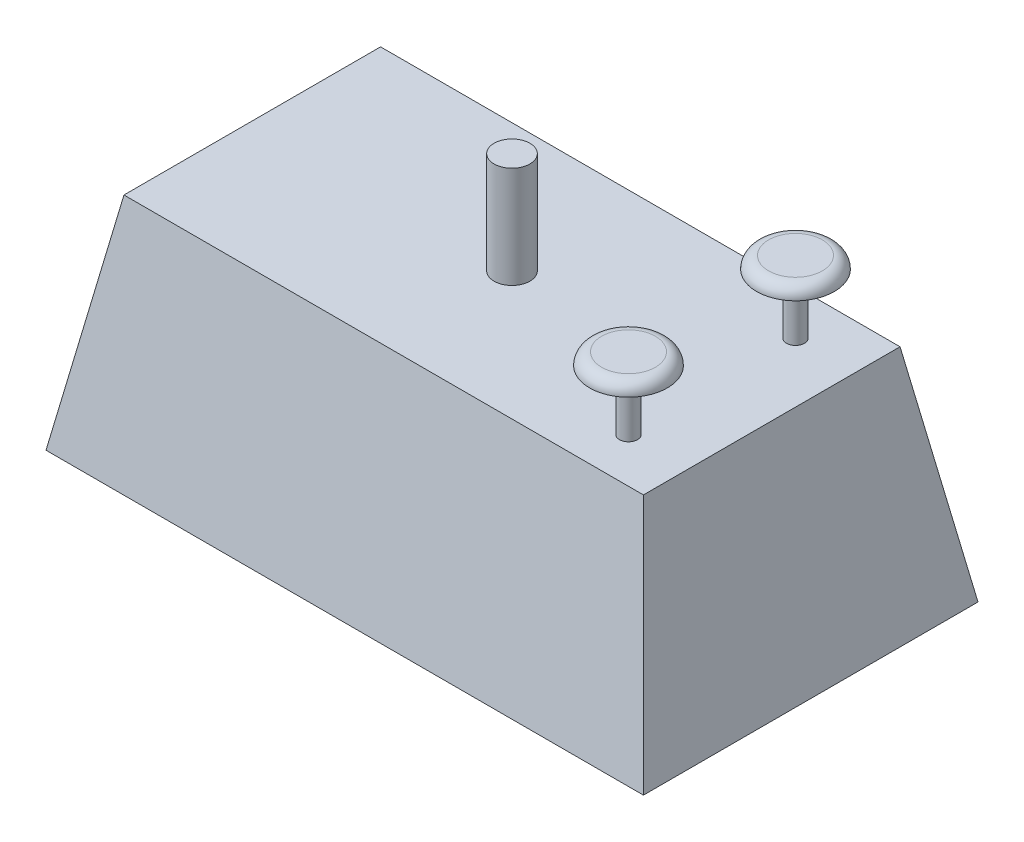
ISO-10303-21;
HEADER;
FILE_DESCRIPTION(('STEP AP214'),'2;1');
FILE_NAME('part.step','',(''),(''),'','','');
FILE_SCHEMA(('AUTOMOTIVE_DESIGN { 1 0 10303 214 1 1 1 1 }'));
ENDSEC;
DATA;
#1=APPLICATION_CONTEXT('core data for automotive mechanical design processes');
#2=APPLICATION_PROTOCOL_DEFINITION('international standard','automotive_design',2000,#1);
#3=PRODUCT_CONTEXT('',#1,'mechanical');
#4=PRODUCT('Part','Part','',(#3));
#5=PRODUCT_RELATED_PRODUCT_CATEGORY('part','',(#4));
#6=PRODUCT_DEFINITION_FORMATION('','',#4);
#7=PRODUCT_DEFINITION_CONTEXT('part definition',#1,'design');
#8=PRODUCT_DEFINITION('design','',#6,#7);
#9=PRODUCT_DEFINITION_SHAPE('','',#8);
#10=(LENGTH_UNIT() NAMED_UNIT(*) SI_UNIT(.MILLI.,.METRE.));
#11=(NAMED_UNIT(*) PLANE_ANGLE_UNIT() SI_UNIT($,.RADIAN.));
#12=(NAMED_UNIT(*) SI_UNIT($,.STERADIAN.) SOLID_ANGLE_UNIT());
#13=UNCERTAINTY_MEASURE_WITH_UNIT(LENGTH_MEASURE(1.E-05),#10,'distance_accuracy_value','');
#14=(GEOMETRIC_REPRESENTATION_CONTEXT(3) GLOBAL_UNCERTAINTY_ASSIGNED_CONTEXT((#13)) GLOBAL_UNIT_ASSIGNED_CONTEXT((#10,
#11,#12)) REPRESENTATION_CONTEXT('',''));
#15=CARTESIAN_POINT('',(0.,0.,0.));
#16=DIRECTION('',(0.,0.,1.));
#17=DIRECTION('',(1.,0.,0.));
#18=AXIS2_PLACEMENT_3D('',#15,#16,#17);
#19=CARTESIAN_POINT('',(-500.,0.,-280.));
#20=DIRECTION('',(-0.984807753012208,0.173648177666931,0.));
#21=DIRECTION('',(-0.173648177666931,-0.984807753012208,0.));
#22=AXIS2_PLACEMENT_3D('',#19,#20,#21);
#23=PLANE('',#22);
#24=DIRECTION('',(0.,0.,1.));
#25=VECTOR('',#24,1.);
#26=CARTESIAN_POINT('',(-500.,0.,-280.));
#27=LINE('',#26,#25);
#28=CARTESIAN_POINT('',(-500.,0.,-280.));
#29=VERTEX_POINT('',#28);
#30=CARTESIAN_POINT('',(-500.,0.,280.));
#31=VERTEX_POINT('',#30);
#32=EDGE_CURVE('E92',#29,#31,#27,.T.);
#33=ORIENTED_EDGE('',*,*,#32,.T.);
#34=DIRECTION('',(-0.171087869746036,-0.970287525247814,0.171087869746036));
#35=VECTOR('',#34,1.);
#36=CARTESIAN_POINT('',(-500.,0.,280.));
#37=LINE('',#36,#35);
#38=CARTESIAN_POINT('',(-434.759017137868,370.,214.759017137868));
#39=VERTEX_POINT('',#38);
#40=EDGE_CURVE('E100',#39,#31,#37,.T.);
#41=ORIENTED_EDGE('',*,*,#40,.F.);
#42=DIRECTION('',(0.,0.,-1.));
#43=VECTOR('',#42,1.);
#44=CARTESIAN_POINT('',(-434.759017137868,370.,-280.));
#45=LINE('',#44,#43);
#46=CARTESIAN_POINT('',(-434.759017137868,370.,-214.759017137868));
#47=VERTEX_POINT('',#46);
#48=EDGE_CURVE('E124',#47,#39,#45,.F.);
#49=ORIENTED_EDGE('',*,*,#48,.F.);
#50=DIRECTION('',(-0.171087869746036,-0.970287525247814,-0.171087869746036));
#51=VECTOR('',#50,1.);
#52=CARTESIAN_POINT('',(-500.,0.,-280.));
#53=LINE('',#52,#51);
#54=EDGE_CURVE('E110',#47,#29,#53,.T.);
#55=ORIENTED_EDGE('',*,*,#54,.T.);
#56=EDGE_LOOP('',(#33,#41,#49,#55));
#57=FACE_BOUND('',#56,.T.);
#58=ADVANCED_FACE('F45',(#57),#23,.T.);
#59=CARTESIAN_POINT('',(-500.,0.,280.));
#60=DIRECTION('',(0.,0.173648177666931,0.984807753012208));
#61=DIRECTION('',(0.,-0.984807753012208,0.173648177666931));
#62=AXIS2_PLACEMENT_3D('',#59,#60,#61);
#63=PLANE('',#62);
#64=DIRECTION('',(1.,0.,0.));
#65=VECTOR('',#64,1.);
#66=CARTESIAN_POINT('',(-500.,0.,280.));
#67=LINE('',#66,#65);
#68=CARTESIAN_POINT('',(500.,0.,280.));
#69=VERTEX_POINT('',#68);
#70=EDGE_CURVE('E87',#31,#69,#67,.T.);
#71=ORIENTED_EDGE('',*,*,#70,.T.);
#72=DIRECTION('',(0.171087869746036,-0.970287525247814,0.171087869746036));
#73=VECTOR('',#72,1.);
#74=CARTESIAN_POINT('',(483.608206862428,92.9624784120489,263.608206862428));
#75=LINE('',#74,#73);
#76=CARTESIAN_POINT('',(434.759017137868,370.,214.759017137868));
#77=VERTEX_POINT('',#76);
#78=EDGE_CURVE('E107',#77,#69,#75,.T.);
#79=ORIENTED_EDGE('',*,*,#78,.F.);
#80=DIRECTION('',(-1.,0.,0.));
#81=VECTOR('',#80,1.);
#82=CARTESIAN_POINT('',(-500.,370.,214.759017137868));
#83=LINE('',#82,#81);
#84=EDGE_CURVE('E102',#39,#77,#83,.F.);
#85=ORIENTED_EDGE('',*,*,#84,.F.);
#86=ORIENTED_EDGE('',*,*,#40,.T.);
#87=EDGE_LOOP('',(#71,#79,#85,#86));
#88=FACE_BOUND('',#87,.T.);
#89=ADVANCED_FACE('F101',(#88),#63,.T.);
#90=CARTESIAN_POINT('',(500.,0.,-280.));
#91=DIRECTION('',(0.984807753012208,0.173648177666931,0.));
#92=DIRECTION('',(-0.173648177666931,0.984807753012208,0.));
#93=AXIS2_PLACEMENT_3D('',#90,#91,#92);
#94=PLANE('',#93);
#95=DIRECTION('',(0.,0.,-1.));
#96=VECTOR('',#95,1.);
#97=CARTESIAN_POINT('',(500.,0.,-280.));
#98=LINE('',#97,#96);
#99=CARTESIAN_POINT('',(500.,0.,-280.));
#100=VERTEX_POINT('',#99);
#101=EDGE_CURVE('E93',#69,#100,#98,.T.);
#102=ORIENTED_EDGE('',*,*,#101,.T.);
#103=DIRECTION('',(0.171087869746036,-0.970287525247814,-0.171087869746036));
#104=VECTOR('',#103,1.);
#105=CARTESIAN_POINT('',(470.728940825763,166.004425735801,-250.728940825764));
#106=LINE('',#105,#104);
#107=CARTESIAN_POINT('',(434.759017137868,370.,-214.759017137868));
#108=VERTEX_POINT('',#107);
#109=EDGE_CURVE('E128',#108,#100,#106,.T.);
#110=ORIENTED_EDGE('',*,*,#109,.F.);
#111=DIRECTION('',(0.,0.,1.));
#112=VECTOR('',#111,1.);
#113=CARTESIAN_POINT('',(434.759017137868,370.,-280.));
#114=LINE('',#113,#112);
#115=EDGE_CURVE('E66',#77,#108,#114,.F.);
#116=ORIENTED_EDGE('',*,*,#115,.F.);
#117=ORIENTED_EDGE('',*,*,#78,.T.);
#118=EDGE_LOOP('',(#102,#110,#116,#117));
#119=FACE_BOUND('',#118,.T.);
#120=ADVANCED_FACE('F182',(#119),#94,.T.);
#121=CARTESIAN_POINT('',(-500.,0.,-280.));
#122=DIRECTION('',(0.,0.173648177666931,-0.984807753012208));
#123=DIRECTION('',(0.,0.984807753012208,0.173648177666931));
#124=AXIS2_PLACEMENT_3D('',#121,#122,#123);
#125=PLANE('',#124);
#126=DIRECTION('',(-1.,0.,0.));
#127=VECTOR('',#126,1.);
#128=CARTESIAN_POINT('',(-500.,0.,-280.));
#129=LINE('',#128,#127);
#130=EDGE_CURVE('E122',#100,#29,#129,.T.);
#131=ORIENTED_EDGE('',*,*,#130,.T.);
#132=ORIENTED_EDGE('',*,*,#54,.F.);
#133=DIRECTION('',(1.,0.,0.));
#134=VECTOR('',#133,1.);
#135=CARTESIAN_POINT('',(-500.,370.,-214.759017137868));
#136=LINE('',#135,#134);
#137=EDGE_CURVE('E61',#108,#47,#136,.F.);
#138=ORIENTED_EDGE('',*,*,#137,.F.);
#139=ORIENTED_EDGE('',*,*,#109,.T.);
#140=EDGE_LOOP('',(#131,#132,#138,#139));
#141=FACE_BOUND('',#140,.T.);
#142=ADVANCED_FACE('F186',(#141),#125,.T.);
#143=CARTESIAN_POINT('',(0.,370.,0.));
#144=DIRECTION('',(0.,1.,0.));
#145=DIRECTION('',(0.,0.,1.));
#146=AXIS2_PLACEMENT_3D('',#143,#144,#145);
#147=PLANE('',#146);
#148=CARTESIAN_POINT('',(0.,370.,0.));
#149=DIRECTION('',(0.,1.,0.));
#150=DIRECTION('',(0.,0.,1.));
#151=AXIS2_PLACEMENT_3D('',#148,#149,#150);
#152=CIRCLE('',#151,30.);
#153=CARTESIAN_POINT('',(0.,370.,30.));
#154=VERTEX_POINT('',#153);
#155=EDGE_CURVE('E266',#154,#154,#152,.T.);
#156=ORIENTED_EDGE('',*,*,#155,.F.);
#157=EDGE_LOOP('',(#156));
#158=FACE_BOUND('',#157,.T.);
#159=CARTESIAN_POINT('',(334.759017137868,370.,139.759017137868));
#160=DIRECTION('',(0.,1.,0.));
#161=DIRECTION('',(0.,0.,1.));
#162=AXIS2_PLACEMENT_3D('',#159,#160,#161);
#163=CIRCLE('',#162,15.);
#164=CARTESIAN_POINT('',(334.759017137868,370.,154.759017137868));
#165=VERTEX_POINT('',#164);
#166=EDGE_CURVE('E279',#165,#165,#163,.T.);
#167=ORIENTED_EDGE('',*,*,#166,.F.);
#168=EDGE_LOOP('',(#167));
#169=FACE_BOUND('',#168,.T.);
#170=CARTESIAN_POINT('',(334.759017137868,370.,-139.759017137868));
#171=DIRECTION('',(0.,1.,0.));
#172=DIRECTION('',(0.,0.,1.));
#173=AXIS2_PLACEMENT_3D('',#170,#171,#172);
#174=CIRCLE('',#173,15.);
#175=CARTESIAN_POINT('',(334.759017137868,370.,-124.759017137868));
#176=VERTEX_POINT('',#175);
#177=EDGE_CURVE('E283',#176,#176,#174,.T.);
#178=ORIENTED_EDGE('',*,*,#177,.F.);
#179=EDGE_LOOP('',(#178));
#180=FACE_BOUND('',#179,.T.);
#181=ORIENTED_EDGE('',*,*,#48,.T.);
#182=ORIENTED_EDGE('',*,*,#84,.T.);
#183=ORIENTED_EDGE('',*,*,#115,.T.);
#184=ORIENTED_EDGE('',*,*,#137,.T.);
#185=EDGE_LOOP('',(#181,#182,#183,#184));
#186=FACE_BOUND('',#185,.T.);
#187=ADVANCED_FACE('F189',(#158,#169,#180,#186),#147,.T.);
#188=CARTESIAN_POINT('',(0.,0.,0.));
#189=DIRECTION('',(0.,1.,0.));
#190=DIRECTION('',(0.,0.,1.));
#191=AXIS2_PLACEMENT_3D('',#188,#189,#190);
#192=PLANE('',#191);
#193=CARTESIAN_POINT('',(320.,0.,-235.));
#194=DIRECTION('',(0.,1.,0.));
#195=DIRECTION('',(0.,0.,1.));
#196=AXIS2_PLACEMENT_3D('',#193,#194,#195);
#197=CIRCLE('',#196,25.);
#198=CARTESIAN_POINT('',(320.,0.,-210.));
#199=VERTEX_POINT('',#198);
#200=EDGE_CURVE('E153',#199,#199,#197,.F.);
#201=ORIENTED_EDGE('',*,*,#200,.F.);
#202=EDGE_LOOP('',(#201));
#203=FACE_BOUND('',#202,.T.);
#204=CARTESIAN_POINT('',(-320.,0.,-235.));
#205=DIRECTION('',(0.,1.,0.));
#206=DIRECTION('',(0.,0.,1.));
#207=AXIS2_PLACEMENT_3D('',#204,#205,#206);
#208=CIRCLE('',#207,25.);
#209=CARTESIAN_POINT('',(-320.,0.,-210.));
#210=VERTEX_POINT('',#209);
#211=EDGE_CURVE('E149',#210,#210,#208,.F.);
#212=ORIENTED_EDGE('',*,*,#211,.F.);
#213=EDGE_LOOP('',(#212));
#214=FACE_BOUND('',#213,.T.);
#215=CARTESIAN_POINT('',(320.,0.,235.));
#216=DIRECTION('',(0.,1.,0.));
#217=DIRECTION('',(0.,0.,1.));
#218=AXIS2_PLACEMENT_3D('',#215,#216,#217);
#219=CIRCLE('',#218,25.);
#220=CARTESIAN_POINT('',(320.,0.,260.));
#221=VERTEX_POINT('',#220);
#222=EDGE_CURVE('E145',#221,#221,#219,.F.);
#223=ORIENTED_EDGE('',*,*,#222,.F.);
#224=EDGE_LOOP('',(#223));
#225=FACE_BOUND('',#224,.T.);
#226=CARTESIAN_POINT('',(-320.,0.,235.));
#227=DIRECTION('',(0.,1.,0.));
#228=DIRECTION('',(0.,0.,1.));
#229=AXIS2_PLACEMENT_3D('',#226,#227,#228);
#230=CIRCLE('',#229,25.);
#231=CARTESIAN_POINT('',(-320.,0.,260.));
#232=VERTEX_POINT('',#231);
#233=EDGE_CURVE('E106',#232,#232,#230,.F.);
#234=ORIENTED_EDGE('',*,*,#233,.F.);
#235=EDGE_LOOP('',(#234));
#236=FACE_BOUND('',#235,.T.);
#237=ORIENTED_EDGE('',*,*,#32,.F.);
#238=ORIENTED_EDGE('',*,*,#130,.F.);
#239=ORIENTED_EDGE('',*,*,#101,.F.);
#240=ORIENTED_EDGE('',*,*,#70,.F.);
#241=EDGE_LOOP('',(#237,#238,#239,#240));
#242=FACE_BOUND('',#241,.T.);
#243=ADVANCED_FACE('F89',(#203,#214,#225,#236,#242),#192,.F.);
#244=CARTESIAN_POINT('',(-320.,-10.,235.));
#245=DIRECTION('',(0.,1.,0.));
#246=DIRECTION('',(0.,0.,1.));
#247=AXIS2_PLACEMENT_3D('',#244,#245,#246);
#248=CYLINDRICAL_SURFACE('',#247,25.);
#249=CARTESIAN_POINT('',(-320.,-10.,235.));
#250=DIRECTION('',(0.,-1.,0.));
#251=DIRECTION('',(0.,0.,-1.));
#252=AXIS2_PLACEMENT_3D('',#249,#250,#251);
#253=CIRCLE('',#252,25.);
#254=CARTESIAN_POINT('',(-320.,-10.,210.));
#255=VERTEX_POINT('',#254);
#256=EDGE_CURVE('E112',#255,#255,#253,.T.);
#257=ORIENTED_EDGE('',*,*,#256,.F.);
#258=EDGE_LOOP('',(#257));
#259=FACE_BOUND('',#258,.T.);
#260=ORIENTED_EDGE('',*,*,#233,.T.);
#261=EDGE_LOOP('',(#260));
#262=FACE_BOUND('',#261,.T.);
#263=ADVANCED_FACE('F200',(#259,#262),#248,.T.);
#264=CARTESIAN_POINT('',(-320.,-10.,235.));
#265=DIRECTION('',(0.,-1.,0.));
#266=DIRECTION('',(0.,0.,-1.));
#267=AXIS2_PLACEMENT_3D('',#264,#265,#266);
#268=PLANE('',#267);
#269=ORIENTED_EDGE('',*,*,#256,.T.);
#270=EDGE_LOOP('',(#269));
#271=FACE_BOUND('',#270,.T.);
#272=ADVANCED_FACE('F207',(#271),#268,.T.);
#273=CARTESIAN_POINT('',(320.,-10.,235.));
#274=DIRECTION('',(0.,1.,0.));
#275=DIRECTION('',(0.,0.,1.));
#276=AXIS2_PLACEMENT_3D('',#273,#274,#275);
#277=CYLINDRICAL_SURFACE('',#276,25.);
#278=CARTESIAN_POINT('',(320.,-10.,235.));
#279=DIRECTION('',(0.,-1.,0.));
#280=DIRECTION('',(0.,0.,-1.));
#281=AXIS2_PLACEMENT_3D('',#278,#279,#280);
#282=CIRCLE('',#281,25.);
#283=CARTESIAN_POINT('',(320.,-10.,210.));
#284=VERTEX_POINT('',#283);
#285=EDGE_CURVE('E116',#284,#284,#282,.T.);
#286=ORIENTED_EDGE('',*,*,#285,.F.);
#287=EDGE_LOOP('',(#286));
#288=FACE_BOUND('',#287,.T.);
#289=ORIENTED_EDGE('',*,*,#222,.T.);
#290=EDGE_LOOP('',(#289));
#291=FACE_BOUND('',#290,.T.);
#292=ADVANCED_FACE('F211',(#288,#291),#277,.T.);
#293=CARTESIAN_POINT('',(320.,-10.,235.));
#294=DIRECTION('',(0.,-1.,0.));
#295=DIRECTION('',(0.,0.,-1.));
#296=AXIS2_PLACEMENT_3D('',#293,#294,#295);
#297=PLANE('',#296);
#298=ORIENTED_EDGE('',*,*,#285,.T.);
#299=EDGE_LOOP('',(#298));
#300=FACE_BOUND('',#299,.T.);
#301=ADVANCED_FACE('F213',(#300),#297,.T.);
#302=CARTESIAN_POINT('',(-320.,-10.,-235.));
#303=DIRECTION('',(0.,1.,0.));
#304=DIRECTION('',(0.,0.,1.));
#305=AXIS2_PLACEMENT_3D('',#302,#303,#304);
#306=CYLINDRICAL_SURFACE('',#305,25.);
#307=CARTESIAN_POINT('',(-320.,-10.,-235.));
#308=DIRECTION('',(0.,-1.,0.));
#309=DIRECTION('',(0.,0.,-1.));
#310=AXIS2_PLACEMENT_3D('',#307,#308,#309);
#311=CIRCLE('',#310,25.);
#312=CARTESIAN_POINT('',(-320.,-10.,-260.));
#313=VERTEX_POINT('',#312);
#314=EDGE_CURVE('E298',#313,#313,#311,.T.);
#315=ORIENTED_EDGE('',*,*,#314,.F.);
#316=EDGE_LOOP('',(#315));
#317=FACE_BOUND('',#316,.T.);
#318=ORIENTED_EDGE('',*,*,#211,.T.);
#319=EDGE_LOOP('',(#318));
#320=FACE_BOUND('',#319,.T.);
#321=ADVANCED_FACE('F216',(#317,#320),#306,.T.);
#322=CARTESIAN_POINT('',(-320.,-10.,-235.));
#323=DIRECTION('',(0.,-1.,0.));
#324=DIRECTION('',(0.,0.,-1.));
#325=AXIS2_PLACEMENT_3D('',#322,#323,#324);
#326=PLANE('',#325);
#327=ORIENTED_EDGE('',*,*,#314,.T.);
#328=EDGE_LOOP('',(#327));
#329=FACE_BOUND('',#328,.T.);
#330=ADVANCED_FACE('F221',(#329),#326,.T.);
#331=CARTESIAN_POINT('',(320.,-10.,-235.));
#332=DIRECTION('',(0.,1.,0.));
#333=DIRECTION('',(0.,0.,1.));
#334=AXIS2_PLACEMENT_3D('',#331,#332,#333);
#335=CYLINDRICAL_SURFACE('',#334,25.);
#336=CARTESIAN_POINT('',(320.,-10.,-235.));
#337=DIRECTION('',(0.,-1.,0.));
#338=DIRECTION('',(0.,0.,-1.));
#339=AXIS2_PLACEMENT_3D('',#336,#337,#338);
#340=CIRCLE('',#339,25.);
#341=CARTESIAN_POINT('',(320.,-10.,-260.));
#342=VERTEX_POINT('',#341);
#343=EDGE_CURVE('E291',#342,#342,#340,.T.);
#344=ORIENTED_EDGE('',*,*,#343,.F.);
#345=EDGE_LOOP('',(#344));
#346=FACE_BOUND('',#345,.T.);
#347=ORIENTED_EDGE('',*,*,#200,.T.);
#348=EDGE_LOOP('',(#347));
#349=FACE_BOUND('',#348,.T.);
#350=ADVANCED_FACE('F224',(#346,#349),#335,.T.);
#351=CARTESIAN_POINT('',(320.,-10.,-235.));
#352=DIRECTION('',(0.,-1.,0.));
#353=DIRECTION('',(0.,0.,-1.));
#354=AXIS2_PLACEMENT_3D('',#351,#352,#353);
#355=PLANE('',#354);
#356=ORIENTED_EDGE('',*,*,#343,.T.);
#357=EDGE_LOOP('',(#356));
#358=FACE_BOUND('',#357,.T.);
#359=ADVANCED_FACE('F229',(#358),#355,.T.);
#360=CARTESIAN_POINT('',(334.759017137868,470.,-139.759017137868));
#361=DIRECTION('',(0.,-1.,0.));
#362=DIRECTION('',(0.,0.,-1.));
#363=AXIS2_PLACEMENT_3D('',#360,#361,#362);
#364=CYLINDRICAL_SURFACE('',#363,15.);
#365=CARTESIAN_POINT('',(334.759017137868,470.,-139.759017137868));
#366=DIRECTION('',(0.,1.,0.));
#367=DIRECTION('',(0.,0.,1.));
#368=AXIS2_PLACEMENT_3D('',#365,#366,#367);
#369=CIRCLE('',#368,15.);
#370=CARTESIAN_POINT('',(334.759017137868,470.,-124.759017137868));
#371=VERTEX_POINT('',#370);
#372=EDGE_CURVE('E287',#371,#371,#369,.T.);
#373=ORIENTED_EDGE('',*,*,#372,.F.);
#374=EDGE_LOOP('',(#373));
#375=FACE_BOUND('',#374,.T.);
#376=ORIENTED_EDGE('',*,*,#177,.T.);
#377=EDGE_LOOP('',(#376));
#378=FACE_BOUND('',#377,.T.);
#379=ADVANCED_FACE('F232',(#375,#378),#364,.T.);
#380=CARTESIAN_POINT('',(334.759017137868,470.,139.759017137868));
#381=DIRECTION('',(0.,-1.,0.));
#382=DIRECTION('',(0.,0.,-1.));
#383=AXIS2_PLACEMENT_3D('',#380,#381,#382);
#384=CYLINDRICAL_SURFACE('',#383,15.);
#385=CARTESIAN_POINT('',(334.759017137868,470.,139.759017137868));
#386=DIRECTION('',(0.,1.,0.));
#387=DIRECTION('',(0.,0.,1.));
#388=AXIS2_PLACEMENT_3D('',#385,#386,#387);
#389=CIRCLE('',#388,15.);
#390=CARTESIAN_POINT('',(334.759017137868,470.,154.759017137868));
#391=VERTEX_POINT('',#390);
#392=EDGE_CURVE('E278',#391,#391,#389,.T.);
#393=ORIENTED_EDGE('',*,*,#392,.F.);
#394=EDGE_LOOP('',(#393));
#395=FACE_BOUND('',#394,.T.);
#396=ORIENTED_EDGE('',*,*,#166,.T.);
#397=EDGE_LOOP('',(#396));
#398=FACE_BOUND('',#397,.T.);
#399=ADVANCED_FACE('F239',(#395,#398),#384,.T.);
#400=CARTESIAN_POINT('',(334.759017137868,490.,139.759017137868));
#401=DIRECTION('',(0.,1.,0.));
#402=DIRECTION('',(0.,0.,1.));
#403=AXIS2_PLACEMENT_3D('',#400,#401,#402);
#404=PLANE('',#403);
#405=CARTESIAN_POINT('',(334.759017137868,490.,139.759017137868));
#406=DIRECTION('',(0.,1.,0.));
#407=DIRECTION('',(0.,0.,1.));
#408=AXIS2_PLACEMENT_3D('',#405,#406,#407);
#409=CIRCLE('',#408,45.);
#410=CARTESIAN_POINT('',(334.759017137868,490.,184.759017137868));
#411=VERTEX_POINT('',#410);
#412=EDGE_CURVE('E54',#411,#411,#409,.T.);
#413=ORIENTED_EDGE('',*,*,#412,.T.);
#414=EDGE_LOOP('',(#413));
#415=FACE_BOUND('',#414,.T.);
#416=ADVANCED_FACE('F160',(#415),#404,.T.);
#417=CARTESIAN_POINT('',(334.759017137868,470.,139.759017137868));
#418=DIRECTION('',(0.,1.,0.));
#419=DIRECTION('',(0.,0.,1.));
#420=AXIS2_PLACEMENT_3D('',#417,#418,#419);
#421=PLANE('',#420);
#422=ORIENTED_EDGE('',*,*,#392,.T.);
#423=EDGE_LOOP('',(#422));
#424=FACE_BOUND('',#423,.T.);
#425=CARTESIAN_POINT('',(334.759017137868,470.,139.759017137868));
#426=DIRECTION('',(0.,1.,0.));
#427=DIRECTION('',(0.,0.,1.));
#428=AXIS2_PLACEMENT_3D('',#425,#426,#427);
#429=CIRCLE('',#428,65.);
#430=CARTESIAN_POINT('',(334.759017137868,470.,204.759017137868));
#431=VERTEX_POINT('',#430);
#432=EDGE_CURVE('E271',#431,#431,#429,.T.);
#433=ORIENTED_EDGE('',*,*,#432,.F.);
#434=EDGE_LOOP('',(#433));
#435=FACE_BOUND('',#434,.T.);
#436=ADVANCED_FACE('F244',(#424,#435),#421,.F.);
#437=CARTESIAN_POINT('',(334.759017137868,490.,-139.759017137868));
#438=DIRECTION('',(0.,1.,0.));
#439=DIRECTION('',(0.,0.,1.));
#440=AXIS2_PLACEMENT_3D('',#437,#438,#439);
#441=PLANE('',#440);
#442=CARTESIAN_POINT('',(334.759017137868,490.,-139.759017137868));
#443=DIRECTION('',(0.,1.,0.));
#444=DIRECTION('',(0.,0.,1.));
#445=AXIS2_PLACEMENT_3D('',#442,#443,#444);
#446=CIRCLE('',#445,45.);
#447=CARTESIAN_POINT('',(334.759017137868,490.,-94.7590171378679));
#448=VERTEX_POINT('',#447);
#449=EDGE_CURVE('E11',#448,#448,#446,.T.);
#450=ORIENTED_EDGE('',*,*,#449,.T.);
#451=EDGE_LOOP('',(#450));
#452=FACE_BOUND('',#451,.T.);
#453=ADVANCED_FACE('F172',(#452),#441,.T.);
#454=CARTESIAN_POINT('',(334.759017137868,470.,-139.759017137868));
#455=DIRECTION('',(0.,1.,0.));
#456=DIRECTION('',(0.,0.,1.));
#457=AXIS2_PLACEMENT_3D('',#454,#455,#456);
#458=PLANE('',#457);
#459=ORIENTED_EDGE('',*,*,#372,.T.);
#460=EDGE_LOOP('',(#459));
#461=FACE_BOUND('',#460,.T.);
#462=CARTESIAN_POINT('',(334.759017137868,470.,-139.759017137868));
#463=DIRECTION('',(0.,1.,0.));
#464=DIRECTION('',(0.,0.,1.));
#465=AXIS2_PLACEMENT_3D('',#462,#463,#464);
#466=CIRCLE('',#465,65.);
#467=CARTESIAN_POINT('',(334.759017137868,470.,-74.7590171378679));
#468=VERTEX_POINT('',#467);
#469=EDGE_CURVE('E265',#468,#468,#466,.T.);
#470=ORIENTED_EDGE('',*,*,#469,.F.);
#471=EDGE_LOOP('',(#470));
#472=FACE_BOUND('',#471,.T.);
#473=ADVANCED_FACE('F164',(#461,#472),#458,.F.);
#474=CARTESIAN_POINT('',(334.759017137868,470.,139.759017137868));
#475=DIRECTION('',(0.,1.,0.));
#476=DIRECTION('',(0.,0.,1.));
#477=AXIS2_PLACEMENT_3D('',#474,#475,#476);
#478=TOROIDAL_SURFACE('',#477,45.,20.);
#479=ORIENTED_EDGE('',*,*,#432,.T.);
#480=EDGE_LOOP('',(#479));
#481=FACE_BOUND('',#480,.T.);
#482=ORIENTED_EDGE('',*,*,#412,.F.);
#483=EDGE_LOOP('',(#482));
#484=FACE_BOUND('',#483,.T.);
#485=ADVANCED_FACE('F162',(#481,#484),#478,.T.);
#486=CARTESIAN_POINT('',(334.759017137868,470.,-139.759017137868));
#487=DIRECTION('',(0.,1.,0.));
#488=DIRECTION('',(0.,0.,1.));
#489=AXIS2_PLACEMENT_3D('',#486,#487,#488);
#490=TOROIDAL_SURFACE('',#489,45.,20.);
#491=ORIENTED_EDGE('',*,*,#469,.T.);
#492=EDGE_LOOP('',(#491));
#493=FACE_BOUND('',#492,.T.);
#494=ORIENTED_EDGE('',*,*,#449,.F.);
#495=EDGE_LOOP('',(#494));
#496=FACE_BOUND('',#495,.T.);
#497=ADVANCED_FACE('F47',(#493,#496),#490,.T.);
#498=CARTESIAN_POINT('',(0.,540.,0.));
#499=DIRECTION('',(0.,-1.,0.));
#500=DIRECTION('',(0.,0.,-1.));
#501=AXIS2_PLACEMENT_3D('',#498,#499,#500);
#502=CYLINDRICAL_SURFACE('',#501,30.);
#503=CARTESIAN_POINT('',(0.,540.,0.));
#504=DIRECTION('',(0.,1.,0.));
#505=DIRECTION('',(0.,0.,1.));
#506=AXIS2_PLACEMENT_3D('',#503,#504,#505);
#507=CIRCLE('',#506,30.);
#508=CARTESIAN_POINT('',(0.,540.,30.));
#509=VERTEX_POINT('',#508);
#510=EDGE_CURVE('E263',#509,#509,#507,.T.);
#511=ORIENTED_EDGE('',*,*,#510,.F.);
#512=EDGE_LOOP('',(#511));
#513=FACE_BOUND('',#512,.T.);
#514=ORIENTED_EDGE('',*,*,#155,.T.);
#515=EDGE_LOOP('',(#514));
#516=FACE_BOUND('',#515,.T.);
#517=ADVANCED_FACE('F170',(#513,#516),#502,.T.);
#518=CARTESIAN_POINT('',(0.,540.,0.));
#519=DIRECTION('',(0.,1.,0.));
#520=DIRECTION('',(0.,0.,1.));
#521=AXIS2_PLACEMENT_3D('',#518,#519,#520);
#522=PLANE('',#521);
#523=ORIENTED_EDGE('',*,*,#510,.T.);
#524=EDGE_LOOP('',(#523));
#525=FACE_BOUND('',#524,.T.);
#526=ADVANCED_FACE('F255',(#525),#522,.T.);
#527=CLOSED_SHELL('',(#58,#89,#120,#142,#187,#243,#263,#272,#292,#301,#321,#330,#350,#359,#379,
#399,#416,#436,#453,#473,#485,#497,#517,#526));
#528=MANIFOLD_SOLID_BREP('B2',#527);
#529=ADVANCED_BREP_SHAPE_REPRESENTATION('',(#18,#528),#14);
#530=SHAPE_DEFINITION_REPRESENTATION(#9,#529);
ENDSEC;
END-ISO-10303-21;
